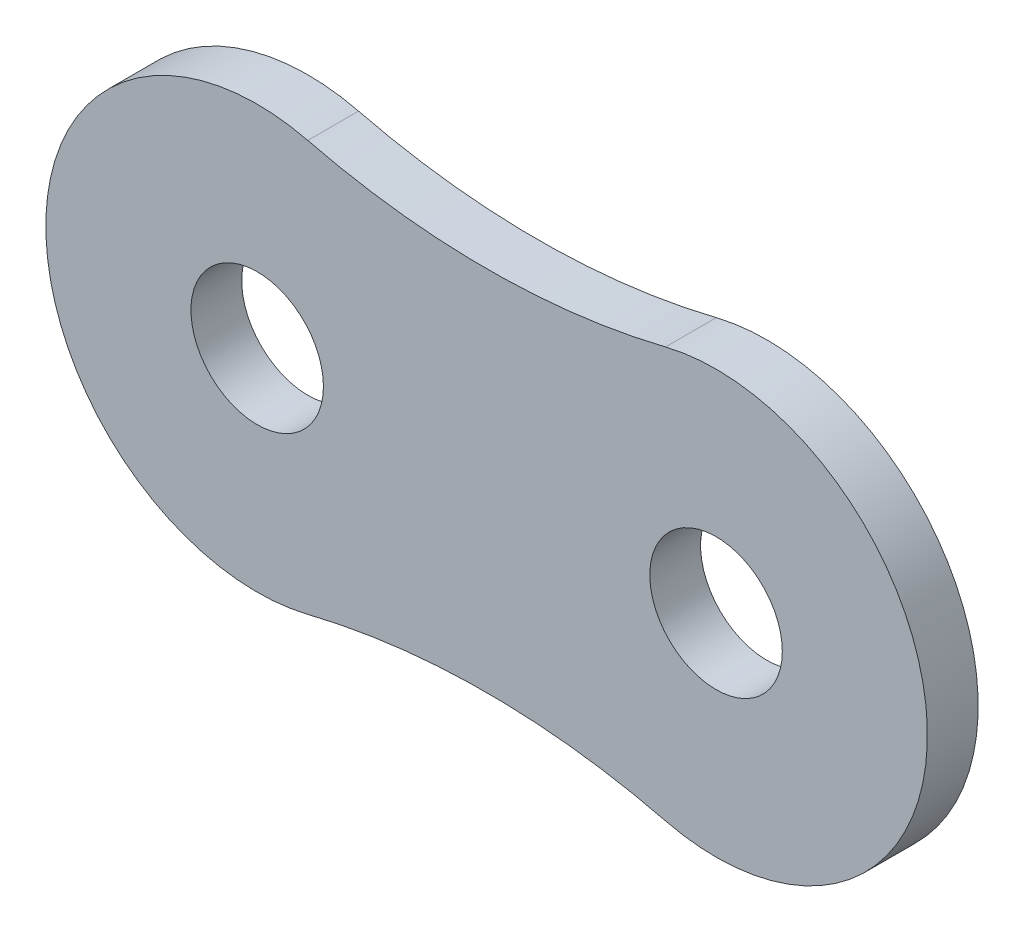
ISO-10303-21;
HEADER;
FILE_DESCRIPTION(('STEP AP214'),'2;1');
FILE_NAME('part.step','',(''),(''),'','','');
FILE_SCHEMA(('AUTOMOTIVE_DESIGN { 1 0 10303 214 1 1 1 1 }'));
ENDSEC;
DATA;
#1=APPLICATION_CONTEXT('core data for automotive mechanical design processes');
#2=APPLICATION_PROTOCOL_DEFINITION('international standard','automotive_design',2000,#1);
#3=PRODUCT_CONTEXT('',#1,'mechanical');
#4=PRODUCT('Part','Part','',(#3));
#5=PRODUCT_RELATED_PRODUCT_CATEGORY('part','',(#4));
#6=PRODUCT_DEFINITION_FORMATION('','',#4);
#7=PRODUCT_DEFINITION_CONTEXT('part definition',#1,'design');
#8=PRODUCT_DEFINITION('design','',#6,#7);
#9=PRODUCT_DEFINITION_SHAPE('','',#8);
#10=(LENGTH_UNIT() NAMED_UNIT(*) SI_UNIT(.MILLI.,.METRE.));
#11=(NAMED_UNIT(*) PLANE_ANGLE_UNIT() SI_UNIT($,.RADIAN.));
#12=(NAMED_UNIT(*) SI_UNIT($,.STERADIAN.) SOLID_ANGLE_UNIT());
#13=UNCERTAINTY_MEASURE_WITH_UNIT(LENGTH_MEASURE(1.E-05),#10,'distance_accuracy_value','');
#14=(GEOMETRIC_REPRESENTATION_CONTEXT(3) GLOBAL_UNCERTAINTY_ASSIGNED_CONTEXT((#13)) GLOBAL_UNIT_ASSIGNED_CONTEXT((#10,
#11,#12)) REPRESENTATION_CONTEXT('',''));
#15=CARTESIAN_POINT('',(0.,0.,0.));
#16=DIRECTION('',(0.,0.,1.));
#17=DIRECTION('',(1.,0.,0.));
#18=AXIS2_PLACEMENT_3D('',#15,#16,#17);
#19=CARTESIAN_POINT('',(0.,-16.2351078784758,0.885));
#20=DIRECTION('',(0.,0.,-1.));
#21=DIRECTION('',(-1.,0.,0.));
#22=AXIS2_PLACEMENT_3D('',#19,#20,#21);
#23=CYLINDRICAL_SURFACE('',#22,13.0356078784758);
#24=CARTESIAN_POINT('',(0.,-16.2351078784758,0.));
#25=DIRECTION('',(0.,0.,-1.));
#26=DIRECTION('',(1.,0.,0.));
#27=AXIS2_PLACEMENT_3D('',#24,#25,#26);
#28=CIRCLE('',#27,13.0356078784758);
#29=CARTESIAN_POINT('',(-3.11845310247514,-3.57800224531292,0.));
#30=VERTEX_POINT('',#29);
#31=CARTESIAN_POINT('',(3.11845310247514,-3.57800224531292,0.));
#32=VERTEX_POINT('',#31);
#33=EDGE_CURVE('E94',#30,#32,#28,.T.);
#34=ORIENTED_EDGE('',*,*,#33,.T.);
#35=DIRECTION('',(0.,0.,-1.));
#36=VECTOR('',#35,1.);
#37=CARTESIAN_POINT('',(3.11845310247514,-3.57800224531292,0.885));
#38=LINE('',#37,#36);
#39=CARTESIAN_POINT('',(3.11845310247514,-3.57800224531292,0.885));
#40=VERTEX_POINT('',#39);
#41=EDGE_CURVE('E11',#40,#32,#38,.T.);
#42=ORIENTED_EDGE('',*,*,#41,.F.);
#43=CARTESIAN_POINT('',(0.,-16.2351078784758,0.885));
#44=DIRECTION('',(0.,0.,-1.));
#45=DIRECTION('',(1.,0.,0.));
#46=AXIS2_PLACEMENT_3D('',#43,#44,#45);
#47=CIRCLE('',#46,13.0356078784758);
#48=CARTESIAN_POINT('',(-3.11845310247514,-3.57800224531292,0.885));
#49=VERTEX_POINT('',#48);
#50=EDGE_CURVE('E82',#49,#40,#47,.T.);
#51=ORIENTED_EDGE('',*,*,#50,.F.);
#52=DIRECTION('',(0.,0.,-1.));
#53=VECTOR('',#52,1.);
#54=CARTESIAN_POINT('',(-3.11845310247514,-3.57800224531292,0.885));
#55=LINE('',#54,#53);
#56=EDGE_CURVE('E90',#49,#30,#55,.T.);
#57=ORIENTED_EDGE('',*,*,#56,.T.);
#58=EDGE_LOOP('',(#34,#42,#51,#57));
#59=FACE_BOUND('',#58,.T.);
#60=ADVANCED_FACE('F31',(#59),#23,.F.);
#61=CARTESIAN_POINT('',(4.,0.,0.885));
#62=DIRECTION('',(0.,0.,-1.));
#63=DIRECTION('',(-1.,0.,0.));
#64=AXIS2_PLACEMENT_3D('',#61,#62,#63);
#65=CYLINDRICAL_SURFACE('',#64,3.685);
#66=CARTESIAN_POINT('',(4.,0.,0.));
#67=DIRECTION('',(0.,0.,1.));
#68=DIRECTION('',(1.,0.,0.));
#69=AXIS2_PLACEMENT_3D('',#66,#67,#68);
#70=CIRCLE('',#69,3.685);
#71=CARTESIAN_POINT('',(3.11845310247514,3.57800224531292,0.));
#72=VERTEX_POINT('',#71);
#73=EDGE_CURVE('E86',#32,#72,#70,.T.);
#74=ORIENTED_EDGE('',*,*,#73,.T.);
#75=DIRECTION('',(0.,0.,-1.));
#76=VECTOR('',#75,1.);
#77=CARTESIAN_POINT('',(3.11845310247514,3.57800224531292,0.885));
#78=LINE('',#77,#76);
#79=CARTESIAN_POINT('',(3.11845310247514,3.57800224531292,0.885));
#80=VERTEX_POINT('',#79);
#81=EDGE_CURVE('E39',#80,#72,#78,.T.);
#82=ORIENTED_EDGE('',*,*,#81,.F.);
#83=CARTESIAN_POINT('',(4.,0.,0.885));
#84=DIRECTION('',(0.,0.,1.));
#85=DIRECTION('',(1.,0.,0.));
#86=AXIS2_PLACEMENT_3D('',#83,#84,#85);
#87=CIRCLE('',#86,3.685);
#88=EDGE_CURVE('E77',#40,#80,#87,.T.);
#89=ORIENTED_EDGE('',*,*,#88,.F.);
#90=ORIENTED_EDGE('',*,*,#41,.T.);
#91=EDGE_LOOP('',(#74,#82,#89,#90));
#92=FACE_BOUND('',#91,.T.);
#93=ADVANCED_FACE('F85',(#92),#65,.T.);
#94=CARTESIAN_POINT('',(0.,16.2351078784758,0.885));
#95=DIRECTION('',(0.,0.,-1.));
#96=DIRECTION('',(-1.,0.,0.));
#97=AXIS2_PLACEMENT_3D('',#94,#95,#96);
#98=CYLINDRICAL_SURFACE('',#97,13.0356078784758);
#99=CARTESIAN_POINT('',(0.,16.2351078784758,0.));
#100=DIRECTION('',(0.,0.,-1.));
#101=DIRECTION('',(1.,0.,0.));
#102=AXIS2_PLACEMENT_3D('',#99,#100,#101);
#103=CIRCLE('',#102,13.0356078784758);
#104=CARTESIAN_POINT('',(-3.11845310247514,3.57800224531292,0.));
#105=VERTEX_POINT('',#104);
#106=EDGE_CURVE('E64',#72,#105,#103,.T.);
#107=ORIENTED_EDGE('',*,*,#106,.T.);
#108=DIRECTION('',(0.,0.,-1.));
#109=VECTOR('',#108,1.);
#110=CARTESIAN_POINT('',(-3.11845310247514,3.57800224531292,0.885));
#111=LINE('',#110,#109);
#112=CARTESIAN_POINT('',(-3.11845310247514,3.57800224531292,0.885));
#113=VERTEX_POINT('',#112);
#114=EDGE_CURVE('E87',#113,#105,#111,.T.);
#115=ORIENTED_EDGE('',*,*,#114,.F.);
#116=CARTESIAN_POINT('',(0.,16.2351078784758,0.885));
#117=DIRECTION('',(0.,0.,-1.));
#118=DIRECTION('',(1.,0.,0.));
#119=AXIS2_PLACEMENT_3D('',#116,#117,#118);
#120=CIRCLE('',#119,13.0356078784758);
#121=EDGE_CURVE('E80',#80,#113,#120,.T.);
#122=ORIENTED_EDGE('',*,*,#121,.F.);
#123=ORIENTED_EDGE('',*,*,#81,.T.);
#124=EDGE_LOOP('',(#107,#115,#122,#123));
#125=FACE_BOUND('',#124,.T.);
#126=ADVANCED_FACE('F88',(#125),#98,.F.);
#127=CARTESIAN_POINT('',(-4.,0.,0.885));
#128=DIRECTION('',(0.,0.,-1.));
#129=DIRECTION('',(-1.,0.,0.));
#130=AXIS2_PLACEMENT_3D('',#127,#128,#129);
#131=CYLINDRICAL_SURFACE('',#130,3.685);
#132=CARTESIAN_POINT('',(-4.,0.,0.));
#133=DIRECTION('',(0.,0.,1.));
#134=DIRECTION('',(1.,0.,0.));
#135=AXIS2_PLACEMENT_3D('',#132,#133,#134);
#136=CIRCLE('',#135,3.685);
#137=EDGE_CURVE('E70',#105,#30,#136,.T.);
#138=ORIENTED_EDGE('',*,*,#137,.T.);
#139=ORIENTED_EDGE('',*,*,#56,.F.);
#140=CARTESIAN_POINT('',(-4.,0.,0.885));
#141=DIRECTION('',(0.,0.,1.));
#142=DIRECTION('',(1.,0.,0.));
#143=AXIS2_PLACEMENT_3D('',#140,#141,#142);
#144=CIRCLE('',#143,3.685);
#145=EDGE_CURVE('E47',#113,#49,#144,.T.);
#146=ORIENTED_EDGE('',*,*,#145,.F.);
#147=ORIENTED_EDGE('',*,*,#114,.T.);
#148=EDGE_LOOP('',(#138,#139,#146,#147));
#149=FACE_BOUND('',#148,.T.);
#150=ADVANCED_FACE('F102',(#149),#131,.T.);
#151=CARTESIAN_POINT('',(-2.,-8.1175539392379,0.885));
#152=DIRECTION('',(0.,0.,1.));
#153=DIRECTION('',(1.,0.,0.));
#154=AXIS2_PLACEMENT_3D('',#151,#152,#153);
#155=PLANE('',#154);
#156=CARTESIAN_POINT('',(4.,0.,0.885));
#157=DIRECTION('',(0.,0.,1.));
#158=DIRECTION('',(1.,0.,0.));
#159=AXIS2_PLACEMENT_3D('',#156,#157,#158);
#160=CIRCLE('',#159,1.155);
#161=CARTESIAN_POINT('',(5.155,0.,0.885));
#162=VERTEX_POINT('',#161);
#163=EDGE_CURVE('E114',#162,#162,#160,.T.);
#164=ORIENTED_EDGE('',*,*,#163,.F.);
#165=EDGE_LOOP('',(#164));
#166=FACE_BOUND('',#165,.T.);
#167=CARTESIAN_POINT('',(-4.,0.,0.885));
#168=DIRECTION('',(0.,0.,1.));
#169=DIRECTION('',(1.,0.,0.));
#170=AXIS2_PLACEMENT_3D('',#167,#168,#169);
#171=CIRCLE('',#170,1.155);
#172=CARTESIAN_POINT('',(-2.845,0.,0.885));
#173=VERTEX_POINT('',#172);
#174=EDGE_CURVE('E108',#173,#173,#171,.T.);
#175=ORIENTED_EDGE('',*,*,#174,.F.);
#176=EDGE_LOOP('',(#175));
#177=FACE_BOUND('',#176,.T.);
#178=ORIENTED_EDGE('',*,*,#50,.T.);
#179=ORIENTED_EDGE('',*,*,#88,.T.);
#180=ORIENTED_EDGE('',*,*,#121,.T.);
#181=ORIENTED_EDGE('',*,*,#145,.T.);
#182=EDGE_LOOP('',(#178,#179,#180,#181));
#183=FACE_BOUND('',#182,.T.);
#184=ADVANCED_FACE('F78',(#166,#177,#183),#155,.T.);
#185=CARTESIAN_POINT('',(-2.,-8.1175539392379,0.));
#186=DIRECTION('',(0.,0.,1.));
#187=DIRECTION('',(1.,0.,0.));
#188=AXIS2_PLACEMENT_3D('',#185,#186,#187);
#189=PLANE('',#188);
#190=CARTESIAN_POINT('',(4.,0.,0.));
#191=DIRECTION('',(0.,0.,1.));
#192=DIRECTION('',(1.,0.,0.));
#193=AXIS2_PLACEMENT_3D('',#190,#191,#192);
#194=CIRCLE('',#193,1.155);
#195=CARTESIAN_POINT('',(5.155,0.,0.));
#196=VERTEX_POINT('',#195);
#197=EDGE_CURVE('E111',#196,#196,#194,.T.);
#198=ORIENTED_EDGE('',*,*,#197,.T.);
#199=EDGE_LOOP('',(#198));
#200=FACE_BOUND('',#199,.T.);
#201=CARTESIAN_POINT('',(-4.,0.,0.));
#202=DIRECTION('',(0.,0.,1.));
#203=DIRECTION('',(1.,0.,0.));
#204=AXIS2_PLACEMENT_3D('',#201,#202,#203);
#205=CIRCLE('',#204,1.155);
#206=CARTESIAN_POINT('',(-2.845,0.,0.));
#207=VERTEX_POINT('',#206);
#208=EDGE_CURVE('E97',#207,#207,#205,.T.);
#209=ORIENTED_EDGE('',*,*,#208,.T.);
#210=EDGE_LOOP('',(#209));
#211=FACE_BOUND('',#210,.T.);
#212=ORIENTED_EDGE('',*,*,#33,.F.);
#213=ORIENTED_EDGE('',*,*,#137,.F.);
#214=ORIENTED_EDGE('',*,*,#106,.F.);
#215=ORIENTED_EDGE('',*,*,#73,.F.);
#216=EDGE_LOOP('',(#212,#213,#214,#215));
#217=FACE_BOUND('',#216,.T.);
#218=ADVANCED_FACE('F105',(#200,#211,#217),#189,.F.);
#219=CARTESIAN_POINT('',(-4.,0.,0.));
#220=DIRECTION('',(0.,0.,1.));
#221=DIRECTION('',(1.,0.,0.));
#222=AXIS2_PLACEMENT_3D('',#219,#220,#221);
#223=CYLINDRICAL_SURFACE('',#222,1.155);
#224=ORIENTED_EDGE('',*,*,#208,.F.);
#225=EDGE_LOOP('',(#224));
#226=FACE_BOUND('',#225,.T.);
#227=ORIENTED_EDGE('',*,*,#174,.T.);
#228=EDGE_LOOP('',(#227));
#229=FACE_BOUND('',#228,.T.);
#230=ADVANCED_FACE('F125',(#226,#229),#223,.F.);
#231=CARTESIAN_POINT('',(4.,0.,0.));
#232=DIRECTION('',(0.,0.,1.));
#233=DIRECTION('',(1.,0.,0.));
#234=AXIS2_PLACEMENT_3D('',#231,#232,#233);
#235=CYLINDRICAL_SURFACE('',#234,1.155);
#236=ORIENTED_EDGE('',*,*,#197,.F.);
#237=EDGE_LOOP('',(#236));
#238=FACE_BOUND('',#237,.T.);
#239=ORIENTED_EDGE('',*,*,#163,.T.);
#240=EDGE_LOOP('',(#239));
#241=FACE_BOUND('',#240,.T.);
#242=ADVANCED_FACE('F122',(#238,#241),#235,.F.);
#243=CLOSED_SHELL('',(#60,#93,#126,#150,#184,#218,#230,#242));
#244=MANIFOLD_SOLID_BREP('B2',#243);
#245=ADVANCED_BREP_SHAPE_REPRESENTATION('',(#18,#244),#14);
#246=SHAPE_DEFINITION_REPRESENTATION(#9,#245);
ENDSEC;
END-ISO-10303-21;
